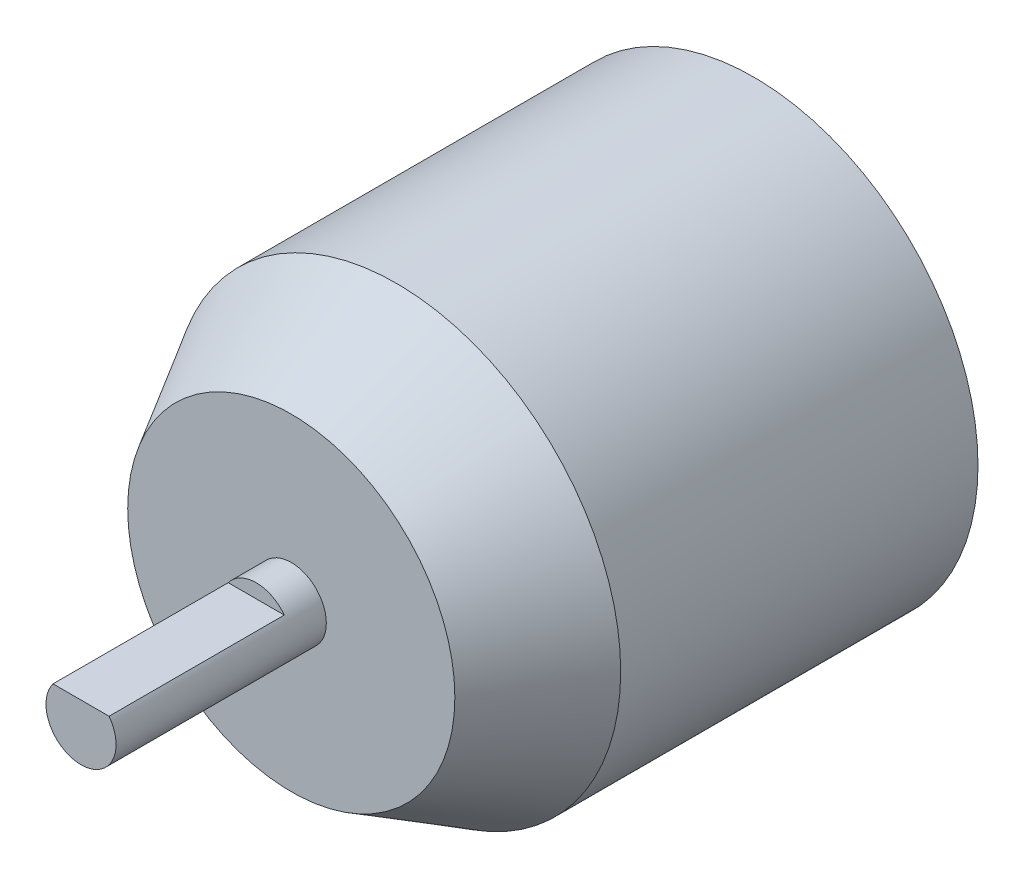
from build123d import *

# Parameters (mm, degrees)
CROQUIS1_R              = 32
SALIENTE_EXTRUIR1_DEPTH = 70
CROQUIS2_R              = 5
SALIENTE_EXTRUIR2_DEPTH = 30
CHAFL_N1_SIZE           = 15
CHAFL_N1_SIZE2          = 8.660254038
CHAFL_N2_SIZE           = 15
CHAFL_N2_SIZE2          = 4.019237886
CROQUIS3_W              = 66.039745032
CROQUIS3_H              = 8.049285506
CORTAR_EXTRUIR1_DEPTH   = 25


with BuildPart() as part:
    # Croquis1 → Saliente-Extruir1 (new body)
    with BuildSketch(Plane.XY):
        Circle(CROQUIS1_R)
    extrude(amount=SALIENTE_EXTRUIR1_DEPTH)

    # Croquis2 → Saliente-Extruir2 (add)
    with BuildSketch(Plane.XY.offset(70)):
        Circle(CROQUIS2_R)
    extrude(amount=SALIENTE_EXTRUIR2_DEPTH)

    # Chafl_n1
    chafl_n1_edges = [part.edges().sort_by_distance(p)[0] for p in [
        (-32, 0, 70),
    ]]
    chafl_n1_side = [part.faces().sort_by_distance(p)[0] for p in [
        (-32, 0, 35),
    ]]
    chamfer(chafl_n1_edges, length=CHAFL_N1_SIZE, length2=CHAFL_N1_SIZE2, reference=chafl_n1_side[0])

    # Chafl_n2
    chafl_n2_edges = [part.edges().sort_by_distance(p)[0] for p in [
        (-32, 0, 0),
    ]]
    chafl_n2_side = [part.faces().sort_by_distance(p)[0] for p in [
        (0, 0, 0),
    ]]
    chamfer(chafl_n2_edges, length=CHAFL_N2_SIZE, length2=CHAFL_N2_SIZE2, reference=chafl_n2_side[0])

    # Croquis3 → Cortar-Extruir1 (cut)
    with BuildSketch(Plane.XY.offset(100)):
        with Locations((0, 7.024642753)):
            Rectangle(CROQUIS3_W, CROQUIS3_H)
    extrude(amount=-CORTAR_EXTRUIR1_DEPTH, mode=Mode.SUBTRACT)


solid = part.part
